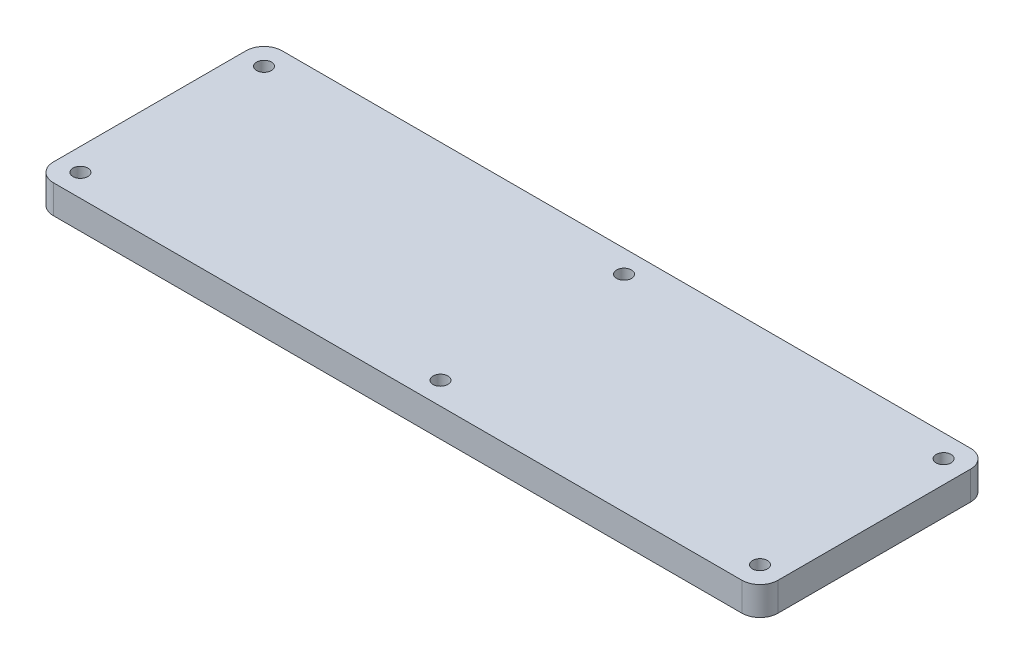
from build123d import *

# Parameters (mm, degrees)
SKETCH1_W             = 161
SKETCH1_H             = 50.8
BOSS_EXTRUDE1_DEPTH   = 6.35
FILLET1_R             = 4
M4X0_7_TAPPED_HOLE1_D = 3.3


with BuildPart() as part:
    # Sketch1 → Boss-Extrude1 (new body)
    with BuildSketch(Plane(origin=(0, 0, 0), x_dir=(1, 0, 0), z_dir=(0, 1, 0))):
        with Locations((34.088372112, 0.214238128)):
            Rectangle(SKETCH1_W, SKETCH1_H)
    extrude(amount=BOSS_EXTRUDE1_DEPTH)

    # Fillet1
    fillet1_edges = [part.edges().sort_by_distance(p)[0] for p in [
        (-46.411627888, 3.175, -25.614238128),
        (114.588372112, 3.175, -25.614238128),
        (114.588372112, 3.175, 25.185761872),
        (-46.411627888, 3.175, 25.185761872),
    ]]
    fillet(fillet1_edges, radius=FILLET1_R)

    # M4x0.7 Tapped Hole1 (through all)
    with Locations(Plane(origin=(0, 6.35, 0), x_dir=(1, 0, 0), z_dir=(0, 1, 0))):
        with Locations((-41.411627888, -20.185761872), (38.588372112, -20.185761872), (109.588372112, -20.185761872), (109.588372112, 20.614238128), (38.588372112, 20.614238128), (-41.411627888, 20.614238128)):
            Hole(M4X0_7_TAPPED_HOLE1_D / 2)


solid = part.part
